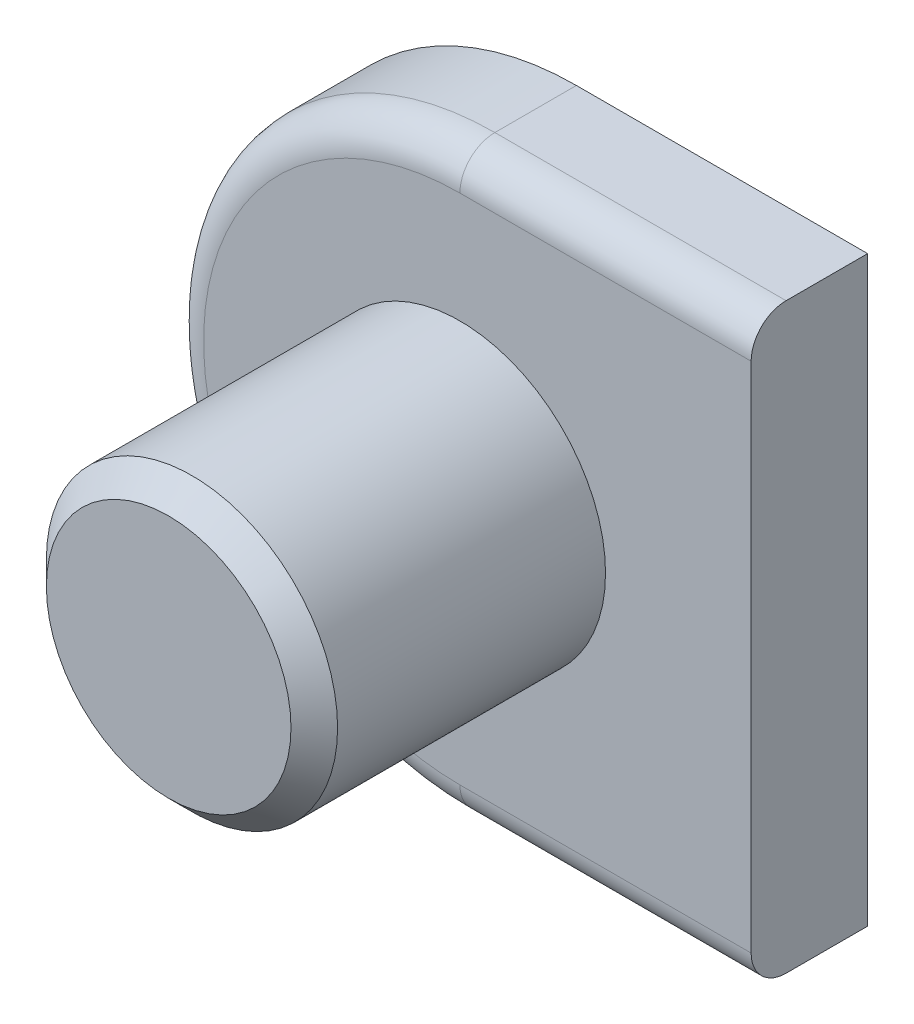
from build123d import *

# Parameters (mm, degrees)
BOSS_EXTRUDE1_DEPTH = 10
SKETCH5_R           = 12.5
BOSS_EXTRUDE2_DEPTH = 25
FILLET1_R           = 3
CHAMFER1_SIZE       = 2


with BuildPart() as part:
    # Sketch4 → Boss-Extrude1 (new body)
    with BuildSketch(Plane.XY):
        with BuildLine():
            Line((12.5, -25), (-12.5, -25))
            ThreePointArc((-12.5, -25), (-37.5, 0), (-12.5, 25))
            Line((-12.5, 25), (12.5, 25))
            Line((12.5, 25), (12.5, -25))
        make_face()
    extrude(amount=BOSS_EXTRUDE1_DEPTH)

    # Sketch5 → Boss-Extrude2 (add)
    with BuildSketch(Plane.XY.offset(10)):
        with Locations((-12.5, 0)):
            Circle(SKETCH5_R)
    extrude(amount=BOSS_EXTRUDE2_DEPTH)

    # Fillet1
    fillet1_edges = [part.edges().sort_by_distance(p)[0] for p in [
        (0, 25, 10),
        (-37.5, 0, 10),
        (0, -25, 10),
    ]]
    fillet(fillet1_edges, radius=FILLET1_R)

    # Chamfer1
    chamfer1_edges = [part.edges().sort_by_distance(p)[0] for p in [
        (-25, 0, 35),
    ]]
    chamfer(chamfer1_edges, length=CHAMFER1_SIZE)


solid = part.part
